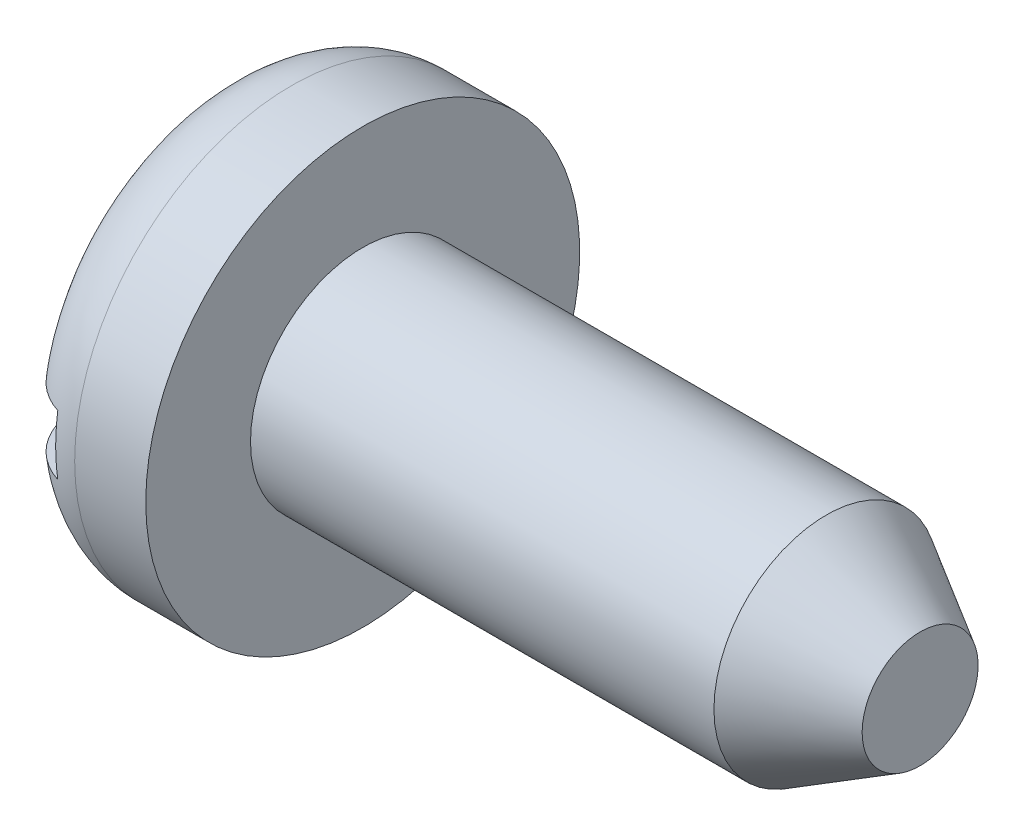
from build123d import *

# Parameters (mm, degrees)
SLOT_CUT_EXTRUDE1_DEPTH      = 6.20991095
SLOT_CUT_EXTRUDE1_DEPTH_BACK = 6.20991095
SKETCH2_W                    = 0.3556
SKETCH2_H                    = 0.4064


with BuildPart() as part:
    # Sketch1 → base-Revolve (revolve)
    with BuildSketch(Plane.XY, mode=Mode.PRIVATE) as base_revolve_sk:
        with BuildLine():
            Line((0, 0), (0, 0.9652))
            ThreePointArc((0, 0.9652), (0.148789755, 1.324410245), (0.508, 1.4732))
            Line((0.508, 1.4732), (0.9906, 1.4732))
            Line((0.9906, 1.4732), (0.9906, 0.762))
            Line((0.9906, 0.762), (4.7752, 0.762))
            Line((4.7752, 0.762), (4.7752, 0))
            Line((4.7752, 0), (0, 0))
        make_face()
    revolve(base_revolve_sk.sketch.rotate(Axis((0, 0, 0), (1, 0, 0)), 90), axis=Axis((0, 0, 0), (1, 0, 0)))

    # Sketch2 → slot_Cut-Extrude1 (cut, two sides: drawn at the far end of the back side and taken through both)
    with BuildSketch(Plane.XY.offset(-SLOT_CUT_EXTRUDE1_DEPTH_BACK)):
        with Locations((0.1778, 0)):
            Rectangle(SKETCH2_W, SKETCH2_H)
    extrude(amount=SLOT_CUT_EXTRUDE1_DEPTH + SLOT_CUT_EXTRUDE1_DEPTH_BACK, mode=Mode.SUBTRACT)

    # Sketch8 → point_Cut-Revolve1 (revolve, cut)
    with BuildSketch(Plane.XY, mode=Mode.PRIVATE) as point_cut_revolve1_sk:
        Polygon((4.7752, 0), (5.2832, 0), (5.2832, 1.27), (4.137285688, 1.27), (4.137285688, 0.762), (4.7752, 0.3937), align=None)
    revolve(point_cut_revolve1_sk.sketch.rotate(Axis((0, 0, 0), (1, 0, 0)), 90), axis=Axis((0, 0, 0), (1, 0, 0)), mode=Mode.SUBTRACT)


solid = part.part
